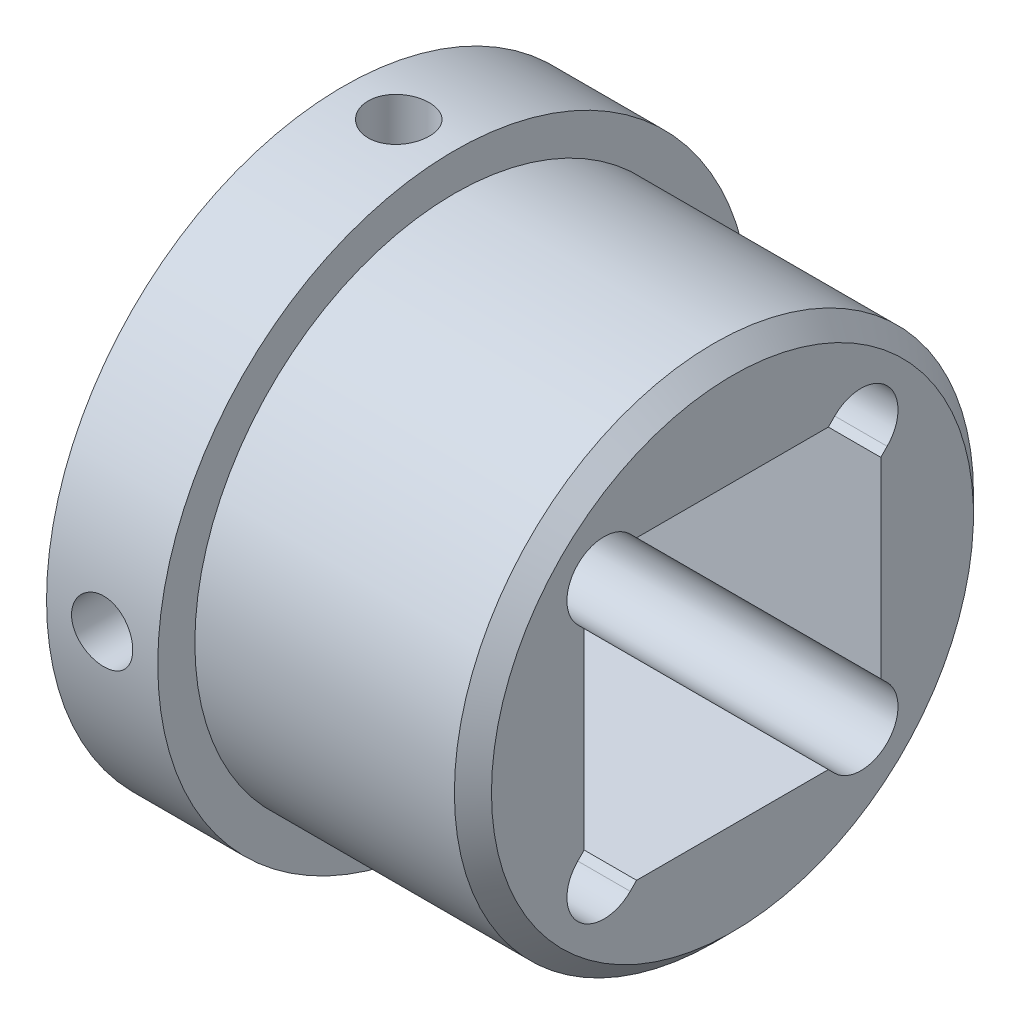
ISO-10303-21;
HEADER;
FILE_DESCRIPTION(('STEP AP214'),'2;1');
FILE_NAME('part.step','',(''),(''),'','','');
FILE_SCHEMA(('AUTOMOTIVE_DESIGN { 1 0 10303 214 1 1 1 1 }'));
ENDSEC;
DATA;
#1=APPLICATION_CONTEXT('core data for automotive mechanical design processes');
#2=APPLICATION_PROTOCOL_DEFINITION('international standard','automotive_design',2000,#1);
#3=PRODUCT_CONTEXT('',#1,'mechanical');
#4=PRODUCT('Part','Part','',(#3));
#5=PRODUCT_RELATED_PRODUCT_CATEGORY('part','',(#4));
#6=PRODUCT_DEFINITION_FORMATION('','',#4);
#7=PRODUCT_DEFINITION_CONTEXT('part definition',#1,'design');
#8=PRODUCT_DEFINITION('design','',#6,#7);
#9=PRODUCT_DEFINITION_SHAPE('','',#8);
#10=(LENGTH_UNIT() NAMED_UNIT(*) SI_UNIT(.MILLI.,.METRE.));
#11=(NAMED_UNIT(*) PLANE_ANGLE_UNIT() SI_UNIT($,.RADIAN.));
#12=(NAMED_UNIT(*) SI_UNIT($,.STERADIAN.) SOLID_ANGLE_UNIT());
#13=UNCERTAINTY_MEASURE_WITH_UNIT(LENGTH_MEASURE(1.E-05),#10,'distance_accuracy_value','');
#14=(GEOMETRIC_REPRESENTATION_CONTEXT(3) GLOBAL_UNCERTAINTY_ASSIGNED_CONTEXT((#13)) GLOBAL_UNIT_ASSIGNED_CONTEXT((#10,
#11,#12)) REPRESENTATION_CONTEXT('',''));
#15=CARTESIAN_POINT('',(0.,0.,0.));
#16=DIRECTION('',(0.,0.,1.));
#17=DIRECTION('',(1.,0.,0.));
#18=AXIS2_PLACEMENT_3D('',#15,#16,#17);
#19=CARTESIAN_POINT('',(0.,-8.,8.));
#20=DIRECTION('',(0.,-1.,0.));
#21=DIRECTION('',(0.,0.,-1.));
#22=AXIS2_PLACEMENT_3D('',#19,#20,#21);
#23=PLANE('',#22);
#24=DIRECTION('',(0.,0.,-1.));
#25=VECTOR('',#24,1.);
#26=CARTESIAN_POINT('',(0.,-8.,8.));
#27=LINE('',#26,#25);
#28=CARTESIAN_POINT('',(0.,-8.,5.17157287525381));
#29=VERTEX_POINT('',#28);
#30=CARTESIAN_POINT('',(0.,-8.00000000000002,-5.17157287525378));
#31=VERTEX_POINT('',#30);
#32=EDGE_CURVE('E286',#29,#31,#27,.T.);
#33=ORIENTED_EDGE('',*,*,#32,.F.);
#34=DIRECTION('',(1.,0.,0.));
#35=VECTOR('',#34,1.);
#36=CARTESIAN_POINT('',(0.,-8.,5.17157287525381));
#37=LINE('',#36,#35);
#38=CARTESIAN_POINT('',(21.,-8.,5.17157287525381));
#39=VERTEX_POINT('',#38);
#40=EDGE_CURVE('E213',#29,#39,#37,.T.);
#41=ORIENTED_EDGE('',*,*,#40,.T.);
#42=DIRECTION('',(0.,0.,-1.));
#43=VECTOR('',#42,1.);
#44=CARTESIAN_POINT('',(21.,-8.,8.));
#45=LINE('',#44,#43);
#46=CARTESIAN_POINT('',(21.,-8.00000000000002,-5.17157287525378));
#47=VERTEX_POINT('',#46);
#48=EDGE_CURVE('E296',#39,#47,#45,.T.);
#49=ORIENTED_EDGE('',*,*,#48,.T.);
#50=DIRECTION('',(1.,0.,0.));
#51=VECTOR('',#50,1.);
#52=CARTESIAN_POINT('',(0.,-8.00000000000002,-5.17157287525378));
#53=LINE('',#52,#51);
#54=EDGE_CURVE('E237',#31,#47,#53,.T.);
#55=ORIENTED_EDGE('',*,*,#54,.F.);
#56=EDGE_LOOP('',(#33,#41,#49,#55));
#57=FACE_BOUND('',#56,.T.);
#58=CARTESIAN_POINT('',(3.,-8.,0.));
#59=DIRECTION('',(0.,1.,0.));
#60=DIRECTION('',(0.,0.,1.));
#61=AXIS2_PLACEMENT_3D('',#58,#59,#60);
#62=CIRCLE('',#61,1.64999999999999);
#63=CARTESIAN_POINT('',(3.,-8.,1.64999999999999));
#64=VERTEX_POINT('',#63);
#65=EDGE_CURVE('E273',#64,#64,#62,.T.);
#66=ORIENTED_EDGE('',*,*,#65,.F.);
#67=EDGE_LOOP('',(#66));
#68=FACE_BOUND('',#67,.T.);
#69=ADVANCED_FACE('F37',(#57,#68),#23,.F.);
#70=CARTESIAN_POINT('',(0.,0.,0.));
#71=DIRECTION('',(1.,0.,0.));
#72=DIRECTION('',(0.,0.,-1.));
#73=AXIS2_PLACEMENT_3D('',#70,#71,#72);
#74=PLANE('',#73);
#75=DIRECTION('',(0.,0.,1.));
#76=VECTOR('',#75,1.);
#77=CARTESIAN_POINT('',(0.,8.,8.));
#78=LINE('',#77,#76);
#79=CARTESIAN_POINT('',(0.,8.,-5.17157287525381));
#80=VERTEX_POINT('',#79);
#81=CARTESIAN_POINT('',(0.,8.,5.17157287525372));
#82=VERTEX_POINT('',#81);
#83=EDGE_CURVE('E291',#80,#82,#78,.T.);
#84=ORIENTED_EDGE('',*,*,#83,.T.);
#85=DIRECTION('',(0.,0.707106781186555,0.70710678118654));
#86=VECTOR('',#85,1.);
#87=CARTESIAN_POINT('',(0.,8.34386001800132,5.51543289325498));
#88=LINE('',#87,#86);
#89=CARTESIAN_POINT('',(0.,8.34386001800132,5.51543289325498));
#90=VERTEX_POINT('',#89);
#91=EDGE_CURVE('E58',#82,#90,#88,.T.);
#92=ORIENTED_EDGE('',*,*,#91,.T.);
#93=CARTESIAN_POINT('',(0.,6.92964645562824,6.92964645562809));
#94=DIRECTION('',(1.,0.,0.));
#95=DIRECTION('',(0.,1.,0.));
#96=AXIS2_PLACEMENT_3D('',#93,#94,#95);
#97=CIRCLE('',#96,2.);
#98=CARTESIAN_POINT('',(0.,5.51543289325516,8.34386001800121));
#99=VERTEX_POINT('',#98);
#100=EDGE_CURVE('E162',#90,#99,#97,.T.);
#101=ORIENTED_EDGE('',*,*,#100,.T.);
#102=DIRECTION('',(0.,-0.707106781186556,-0.707106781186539));
#103=VECTOR('',#102,1.);
#104=CARTESIAN_POINT('',(0.,5.51543289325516,8.34386001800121));
#105=LINE('',#104,#103);
#106=CARTESIAN_POINT('',(0.,5.1715728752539,7.99999999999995));
#107=VERTEX_POINT('',#106);
#108=EDGE_CURVE('E169',#99,#107,#105,.T.);
#109=ORIENTED_EDGE('',*,*,#108,.T.);
#110=DIRECTION('',(0.,-1.,0.));
#111=VECTOR('',#110,1.);
#112=CARTESIAN_POINT('',(0.,8.,8.));
#113=LINE('',#112,#111);
#114=CARTESIAN_POINT('',(0.,-5.1715728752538,8.));
#115=VERTEX_POINT('',#114);
#116=EDGE_CURVE('E66',#107,#115,#113,.T.);
#117=ORIENTED_EDGE('',*,*,#116,.T.);
#118=DIRECTION('',(0.,-0.707106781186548,0.707106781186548));
#119=VECTOR('',#118,1.);
#120=CARTESIAN_POINT('',(0.,-5.51543289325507,8.34386001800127));
#121=LINE('',#120,#119);
#122=CARTESIAN_POINT('',(0.,-5.51543289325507,8.34386001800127));
#123=VERTEX_POINT('',#122);
#124=EDGE_CURVE('E198',#115,#123,#121,.T.);
#125=ORIENTED_EDGE('',*,*,#124,.T.);
#126=CARTESIAN_POINT('',(0.,-6.92964645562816,6.92964645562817));
#127=DIRECTION('',(1.,0.,0.));
#128=DIRECTION('',(0.,0.,1.));
#129=AXIS2_PLACEMENT_3D('',#126,#127,#128);
#130=CIRCLE('',#129,2.);
#131=CARTESIAN_POINT('',(0.,-8.34386001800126,5.51543289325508));
#132=VERTEX_POINT('',#131);
#133=EDGE_CURVE('E191',#123,#132,#130,.T.);
#134=ORIENTED_EDGE('',*,*,#133,.T.);
#135=DIRECTION('',(0.,0.707106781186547,-0.707106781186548));
#136=VECTOR('',#135,1.);
#137=CARTESIAN_POINT('',(0.,-8.34386001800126,5.51543289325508));
#138=LINE('',#137,#136);
#139=EDGE_CURVE('E194',#132,#29,#138,.T.);
#140=ORIENTED_EDGE('',*,*,#139,.T.);
#141=ORIENTED_EDGE('',*,*,#32,.T.);
#142=DIRECTION('',(0.,-0.70710678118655,-0.707106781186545));
#143=VECTOR('',#142,1.);
#144=CARTESIAN_POINT('',(0.,-8.34386001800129,-5.51543289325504));
#145=LINE('',#144,#143);
#146=CARTESIAN_POINT('',(0.,-8.34386001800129,-5.51543289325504));
#147=VERTEX_POINT('',#146);
#148=EDGE_CURVE('E224',#31,#147,#145,.T.);
#149=ORIENTED_EDGE('',*,*,#148,.T.);
#150=CARTESIAN_POINT('',(0.,-6.92964645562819,-6.92964645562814));
#151=DIRECTION('',(1.,0.,0.));
#152=DIRECTION('',(0.,-1.,0.));
#153=AXIS2_PLACEMENT_3D('',#150,#151,#152);
#154=CIRCLE('',#153,2.);
#155=CARTESIAN_POINT('',(0.,-5.51543289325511,-8.34386001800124));
#156=VERTEX_POINT('',#155);
#157=EDGE_CURVE('E217',#147,#156,#154,.T.);
#158=ORIENTED_EDGE('',*,*,#157,.T.);
#159=DIRECTION('',(0.,0.707106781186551,0.707106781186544));
#160=VECTOR('',#159,1.);
#161=CARTESIAN_POINT('',(0.,-5.51543289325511,-8.34386001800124));
#162=LINE('',#161,#160);
#163=CARTESIAN_POINT('',(0.,-5.17157287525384,-7.99999999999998));
#164=VERTEX_POINT('',#163);
#165=EDGE_CURVE('E220',#156,#164,#162,.T.);
#166=ORIENTED_EDGE('',*,*,#165,.T.);
#167=DIRECTION('',(0.,1.,0.));
#168=VECTOR('',#167,1.);
#169=CARTESIAN_POINT('',(0.,8.,-8.));
#170=LINE('',#169,#168);
#171=CARTESIAN_POINT('',(0.,5.1715728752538,-8.));
#172=VERTEX_POINT('',#171);
#173=EDGE_CURVE('E289',#164,#172,#170,.T.);
#174=ORIENTED_EDGE('',*,*,#173,.T.);
#175=DIRECTION('',(0.,0.707106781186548,-0.707106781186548));
#176=VECTOR('',#175,1.);
#177=CARTESIAN_POINT('',(0.,5.51543289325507,-8.34386001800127));
#178=LINE('',#177,#176);
#179=CARTESIAN_POINT('',(0.,5.51543289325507,-8.34386001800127));
#180=VERTEX_POINT('',#179);
#181=EDGE_CURVE('E251',#172,#180,#178,.T.);
#182=ORIENTED_EDGE('',*,*,#181,.T.);
#183=CARTESIAN_POINT('',(0.,6.92964645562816,-6.92964645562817));
#184=DIRECTION('',(1.,0.,0.));
#185=DIRECTION('',(0.,0.,-1.));
#186=AXIS2_PLACEMENT_3D('',#183,#184,#185);
#187=CIRCLE('',#186,2.);
#188=CARTESIAN_POINT('',(0.,8.34386001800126,-5.51543289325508));
#189=VERTEX_POINT('',#188);
#190=EDGE_CURVE('E244',#180,#189,#187,.T.);
#191=ORIENTED_EDGE('',*,*,#190,.T.);
#192=DIRECTION('',(0.,-0.707106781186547,0.707106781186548));
#193=VECTOR('',#192,1.);
#194=CARTESIAN_POINT('',(0.,8.34386001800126,-5.51543289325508));
#195=LINE('',#194,#193);
#196=EDGE_CURVE('E247',#189,#80,#195,.T.);
#197=ORIENTED_EDGE('',*,*,#196,.T.);
#198=EDGE_LOOP('',(#84,#92,#101,#109,#117,#125,#134,#140,#141,#149,#158,#166,#174,#182,#191,#197));
#199=FACE_BOUND('',#198,.T.);
#200=CARTESIAN_POINT('',(0.,0.,0.));
#201=DIRECTION('',(-1.,0.,0.));
#202=DIRECTION('',(0.,0.,1.));
#203=AXIS2_PLACEMENT_3D('',#200,#201,#202);
#204=CIRCLE('',#203,16.);
#205=CARTESIAN_POINT('',(0.,0.,16.));
#206=VERTEX_POINT('',#205);
#207=EDGE_CURVE('E307',#206,#206,#204,.T.);
#208=ORIENTED_EDGE('',*,*,#207,.T.);
#209=EDGE_LOOP('',(#208));
#210=FACE_BOUND('',#209,.T.);
#211=ADVANCED_FACE('F174',(#199,#210),#74,.F.);
#212=CARTESIAN_POINT('',(-19.0972157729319,0.,0.));
#213=DIRECTION('',(-1.,0.,0.));
#214=DIRECTION('',(0.,0.,1.));
#215=AXIS2_PLACEMENT_3D('',#212,#213,#214);
#216=CYLINDRICAL_SURFACE('',#215,16.);
#217=CARTESIAN_POINT('',(4.64999999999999,0.,16.));
#218=CARTESIAN_POINT('',(4.64999600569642,-0.0924179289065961,15.9999989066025));
#219=CARTESIAN_POINT('',(4.64220924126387,-0.184896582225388,15.9991907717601));
#220=CARTESIAN_POINT('',(4.6112644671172,-0.367288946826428,15.9960446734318));
#221=CARTESIAN_POINT('',(4.58808962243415,-0.457199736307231,15.9937050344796));
#222=CARTESIAN_POINT('',(4.52705145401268,-0.631788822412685,15.9877599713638));
#223=CARTESIAN_POINT('',(4.48919711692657,-0.716470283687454,15.9841553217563));
#224=CARTESIAN_POINT('',(4.39989221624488,-0.878259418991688,15.9760830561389));
#225=CARTESIAN_POINT('',(4.34844431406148,-0.955368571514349,15.9716156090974));
#226=CARTESIAN_POINT('',(4.23320217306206,-1.10013660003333,15.9622989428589));
#227=CARTESIAN_POINT('',(4.1693666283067,-1.16776251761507,15.9574484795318));
#228=CARTESIAN_POINT('',(4.03124945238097,-1.29136107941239,15.94792271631));
#229=CARTESIAN_POINT('',(3.95696733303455,-1.34733317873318,15.9432474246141));
#230=CARTESIAN_POINT('',(3.79985832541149,-1.44615275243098,15.9345887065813));
#231=CARTESIAN_POINT('',(3.71701250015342,-1.48897027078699,15.930606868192));
#232=CARTESIAN_POINT('',(3.54525894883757,-1.56007397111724,15.9238014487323));
#233=CARTESIAN_POINT('',(3.45635138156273,-1.5883605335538,15.9209778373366));
#234=CARTESIAN_POINT('',(3.27533502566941,-1.62950135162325,15.9168199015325));
#235=CARTESIAN_POINT('',(3.18323881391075,-1.64241040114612,15.915480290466));
#236=CARTESIAN_POINT('',(2.99817797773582,-1.65259915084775,15.9144256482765));
#237=CARTESIAN_POINT('',(2.90521337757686,-1.64987928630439,15.914710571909));
#238=CARTESIAN_POINT('',(2.72143286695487,-1.62893255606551,15.9168679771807));
#239=CARTESIAN_POINT('',(2.63061004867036,-1.61076557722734,15.9187343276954));
#240=CARTESIAN_POINT('',(2.45330938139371,-1.55953352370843,15.9238347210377));
#241=CARTESIAN_POINT('',(2.36683159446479,-1.5264682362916,15.9270687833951));
#242=CARTESIAN_POINT('',(2.20048695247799,-1.44631226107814,15.9345472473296));
#243=CARTESIAN_POINT('',(2.1206329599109,-1.39919506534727,15.9387935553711));
#244=CARTESIAN_POINT('',(1.9699434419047,-1.29229179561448,15.9478164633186));
#245=CARTESIAN_POINT('',(1.89910819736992,-1.23250532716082,15.9525930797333));
#246=CARTESIAN_POINT('',(1.76811897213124,-1.10162643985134,15.962165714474));
#247=CARTESIAN_POINT('',(1.70801664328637,-1.03048231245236,15.9669617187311));
#248=CARTESIAN_POINT('',(1.60059988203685,-0.879087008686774,15.9760116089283));
#249=CARTESIAN_POINT('',(1.55328546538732,-0.798835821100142,15.9802654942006));
#250=CARTESIAN_POINT('',(1.4727894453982,-0.631468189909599,15.987753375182));
#251=CARTESIAN_POINT('',(1.43961053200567,-0.544350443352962,15.9909871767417));
#252=CARTESIAN_POINT('',(1.38836555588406,-0.365739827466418,15.9960685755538));
#253=CARTESIAN_POINT('',(1.37029901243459,-0.274247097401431,15.9979162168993));
#254=CARTESIAN_POINT('',(1.34985730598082,-0.0899308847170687,16.0000114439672));
#255=CARTESIAN_POINT('',(1.34741088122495,0.00288461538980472,16.0002662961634));
#256=CARTESIAN_POINT('',(1.35809158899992,0.187604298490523,15.9991667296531));
#257=CARTESIAN_POINT('',(1.37121849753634,0.279508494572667,15.9978123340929));
#258=CARTESIAN_POINT('',(1.41261411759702,0.459590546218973,15.993651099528));
#259=CARTESIAN_POINT('',(1.44084939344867,0.547776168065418,15.9908474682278));
#260=CARTESIAN_POINT('',(1.51162584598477,0.718159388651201,15.9841022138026));
#261=CARTESIAN_POINT('',(1.554167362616,0.800356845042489,15.9801605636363));
#262=CARTESIAN_POINT('',(1.6525249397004,0.95675220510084,15.9715618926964));
#263=CARTESIAN_POINT('',(1.7083877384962,1.03092057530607,15.9669023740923));
#264=CARTESIAN_POINT('',(1.83173522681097,1.16885327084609,15.9573986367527));
#265=CARTESIAN_POINT('',(1.89922022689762,1.23261731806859,15.9525544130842));
#266=CARTESIAN_POINT('',(2.04420774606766,1.34817938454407,15.9432053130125));
#267=CARTESIAN_POINT('',(2.1217476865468,1.3999305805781,15.9387018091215));
#268=CARTESIAN_POINT('',(2.28445977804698,1.48967585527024,15.9305651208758));
#269=CARTESIAN_POINT('',(2.36963181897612,1.52767013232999,15.9269319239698));
#270=CARTESIAN_POINT('',(2.54503088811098,1.58874495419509,15.920955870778));
#271=CARTESIAN_POINT('',(2.63524818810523,1.61185319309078,15.9186106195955));
#272=CARTESIAN_POINT('',(2.81830783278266,1.64258976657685,15.9154686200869));
#273=CARTESIAN_POINT('',(2.91115009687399,1.65021857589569,15.9146718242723));
#274=CARTESIAN_POINT('',(3.09635878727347,1.64977290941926,15.9147179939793));
#275=CARTESIAN_POINT('',(3.18872540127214,1.64177198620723,15.9155532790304));
#276=CARTESIAN_POINT('',(3.37079474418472,1.6104483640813,15.9187531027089));
#277=CARTESIAN_POINT('',(3.46049747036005,1.58712564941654,15.9211176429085));
#278=CARTESIAN_POINT('',(3.6346910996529,1.52584110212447,15.9271073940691));
#279=CARTESIAN_POINT('',(3.7191828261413,1.48788158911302,15.9307324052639));
#280=CARTESIAN_POINT('',(3.88060763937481,1.3984084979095,15.9388350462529));
#281=CARTESIAN_POINT('',(3.95754075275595,1.34689496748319,15.9433126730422));
#282=CARTESIAN_POINT('',(4.10204139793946,1.23150018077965,15.9526412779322));
#283=CARTESIAN_POINT('',(4.16956504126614,1.16756409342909,15.9574938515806));
#284=CARTESIAN_POINT('',(4.29295679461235,1.02924864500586,15.9670110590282));
#285=CARTESIAN_POINT('',(4.34882211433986,0.954866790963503,15.9716756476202));
#286=CARTESIAN_POINT('',(4.44742960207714,0.797553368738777,15.9803043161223));
#287=CARTESIAN_POINT('',(4.49013649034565,0.714599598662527,15.9842665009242));
#288=CARTESIAN_POINT('',(4.56095733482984,0.54270963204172,15.9910235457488));
#289=CARTESIAN_POINT('',(4.58908767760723,0.453780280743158,15.9938197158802));
#290=CARTESIAN_POINT('',(4.6229740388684,0.303626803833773,15.9972302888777));
#291=CARTESIAN_POINT('',(4.6330948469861,0.243361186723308,15.9982640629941));
#292=CARTESIAN_POINT('',(4.64660913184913,0.122072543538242,15.9996492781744));
#293=CARTESIAN_POINT('',(4.65000263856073,0.0610495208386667,16.0000007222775));
#294=CARTESIAN_POINT('',(4.64999999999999,0.,16.));
#295=B_SPLINE_CURVE_WITH_KNOTS('',3,(#217,#218,#219,#220,#221,#222,#223,#224,#225,#226,#227,
#228,#229,#230,#231,#232,#233,#234,#235,#236,#237,#238,#239,#240,#241,#242,#243,#244,#245,#246,
#247,#248,#249,#250,#251,#252,#253,#254,#255,#256,#257,#258,#259,#260,#261,#262,#263,#264,#265,
#266,#267,#268,#269,#270,#271,#272,#273,#274,#275,#276,#277,#278,#279,#280,#281,#282,#283,#284,
#285,#286,#287,#288,#289,#290,#291,#292,#293,#294),.UNSPECIFIED.,.T.,.F.,(4,2,2,2,2,2,2,2,2,2,2,
2,2,2,2,2,2,2,2,2,2,2,2,2,2,2,2,2,2,2,2,2,2,2,2,2,2,2,4),(0.,0.277030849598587,
0.554365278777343,0.831530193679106,1.10864088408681,1.38669197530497,1.66475606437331,
1.94344875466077,2.22213414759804,2.49982351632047,2.77750515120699,3.05411512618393,
3.33072905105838,3.60786812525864,3.88501582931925,4.16346332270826,4.44191115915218,
4.72041195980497,4.99890390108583,5.27612439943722,5.5533409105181,5.82994644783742,
6.10655855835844,6.38415583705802,6.66176053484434,6.94042975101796,7.21909494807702,
7.49724020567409,7.77537693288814,8.05220791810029,8.32903918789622,8.60582660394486,
8.88261304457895,9.16065012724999,9.43875367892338,9.71759650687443,9.99612518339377,
10.1791272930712,10.3621285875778),.UNSPECIFIED.);
#296=CARTESIAN_POINT('',(4.64999999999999,0.,16.));
#297=VERTEX_POINT('',#296);
#298=EDGE_CURVE('E41',#297,#297,#295,.T.);
#299=ORIENTED_EDGE('',*,*,#298,.T.);
#300=EDGE_LOOP('',(#299));
#301=FACE_BOUND('',#300,.T.);
#302=CARTESIAN_POINT('',(3.,-15.9146944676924,1.64999999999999));
#303=CARTESIAN_POINT('',(3.09241645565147,-15.9146955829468,1.64999600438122));
#304=CARTESIAN_POINT('',(3.18489364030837,-15.9155081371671,1.64220947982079));
#305=CARTESIAN_POINT('',(3.36728295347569,-15.9186700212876,1.61126574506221));
#306=CARTESIAN_POINT('',(3.45719215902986,-15.9210210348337,1.58809169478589));
#307=CARTESIAN_POINT('',(3.63177789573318,-15.9269907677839,1.52705585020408));
#308=CARTESIAN_POINT('',(3.71645760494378,-15.9306087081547,1.48920308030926));
#309=CARTESIAN_POINT('',(3.87824380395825,-15.9387036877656,1.39990187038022));
#310=CARTESIAN_POINT('',(3.95535177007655,-15.9431805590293,1.34845608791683));
#311=CARTESIAN_POINT('',(4.10012113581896,-15.9525083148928,1.23321608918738));
#312=CARTESIAN_POINT('',(4.16774920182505,-15.9573604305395,1.16938009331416));
#313=CARTESIAN_POINT('',(4.29135191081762,-15.9668808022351,1.03126111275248));
#314=CARTESIAN_POINT('',(4.34732601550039,-15.9715490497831,0.956977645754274));
#315=CARTESIAN_POINT('',(4.44614768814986,-15.9801879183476,0.799867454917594));
#316=CARTESIAN_POINT('',(4.48896566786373,-15.9841569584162,0.717022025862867));
#317=CARTESIAN_POINT('',(4.56007033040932,-15.9909367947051,0.545269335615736));
#318=CARTESIAN_POINT('',(4.58835738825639,-15.9937476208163,0.456362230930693));
#319=CARTESIAN_POINT('',(4.6294992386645,-15.9978856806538,0.275347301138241));
#320=CARTESIAN_POINT('',(4.64240886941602,-15.9992181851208,0.183252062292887));
#321=CARTESIAN_POINT('',(4.65259911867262,-16.0002673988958,-0.00180686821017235));
#322=CARTESIAN_POINT('',(4.64988016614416,-15.9999841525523,-0.0947705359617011));
#323=CARTESIAN_POINT('',(4.62893488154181,-15.9978380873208,-0.278555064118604));
#324=CARTESIAN_POINT('',(4.61076751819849,-15.995981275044,-0.369382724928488));
#325=CARTESIAN_POINT('',(4.55953301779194,-15.9909036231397,-0.546692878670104));
#326=CARTESIAN_POINT('',(4.52646567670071,-15.9876827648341,-0.63317531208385));
#327=CARTESIAN_POINT('',(4.44630544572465,-15.980228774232,-0.79952559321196));
#328=CARTESIAN_POINT('',(4.3991865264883,-15.9759937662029,-0.879380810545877));
#329=CARTESIAN_POINT('',(4.29227957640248,-15.9669865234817,-1.03007204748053));
#330=CARTESIAN_POINT('',(4.2324911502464,-15.962214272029,-1.10090778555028));
#331=CARTESIAN_POINT('',(4.10161087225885,-15.9526417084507,-1.23189480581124));
#332=CARTESIAN_POINT('',(4.03046771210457,-15.9478413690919,-1.29199483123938));
#333=CARTESIAN_POINT('',(3.87907516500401,-15.938775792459,-1.39940740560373));
#334=CARTESIAN_POINT('',(3.79882576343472,-15.9345105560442,-1.44671993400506));
#335=CARTESIAN_POINT('',(3.63145862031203,-15.9269977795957,-1.52721459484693));
#336=CARTESIAN_POINT('',(3.54433929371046,-15.9237504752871,-1.56039345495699));
#337=CARTESIAN_POINT('',(3.36572524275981,-15.9186460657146,-1.6116378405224));
#338=CARTESIAN_POINT('',(3.27423066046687,-15.9167889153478,-1.62970385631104));
#339=CARTESIAN_POINT('',(3.0899135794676,-15.9146829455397,-1.65014357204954));
#340=CARTESIAN_POINT('',(2.99709911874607,-15.9144267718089,-1.65258902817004));
#341=CARTESIAN_POINT('',(2.81238174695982,-15.9155323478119,-1.64190675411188));
#342=CARTESIAN_POINT('',(2.72047882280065,-15.9168940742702,-1.62877924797));
#343=CARTESIAN_POINT('',(2.54040313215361,-15.9210753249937,-1.58738376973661));
#344=CARTESIAN_POINT('',(2.45222246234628,-15.9238915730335,-1.55914981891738));
#345=CARTESIAN_POINT('',(2.28184855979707,-15.9306618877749,-1.48837767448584));
#346=CARTESIAN_POINT('',(2.19965547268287,-15.9346159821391,-1.44583913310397));
#347=CARTESIAN_POINT('',(2.04326310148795,-15.9432342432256,-1.34748594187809));
#348=CARTESIAN_POINT('',(1.96909382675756,-15.9479009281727,-1.29162379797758));
#349=CARTESIAN_POINT('',(1.83115900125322,-15.9574103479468,-1.16827709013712));
#350=CARTESIAN_POINT('',(1.76739372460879,-15.9622530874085,-1.10079222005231));
#351=CARTESIAN_POINT('',(1.65182898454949,-15.9715912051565,-0.955804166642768));
#352=CARTESIAN_POINT('',(1.60007637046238,-15.976085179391,-0.878263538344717));
#353=CARTESIAN_POINT('',(1.51032860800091,-15.9841989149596,-0.715549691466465));
#354=CARTESIAN_POINT('',(1.47233326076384,-15.98781868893,-0.630376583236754));
#355=CARTESIAN_POINT('',(1.41125773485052,-15.993769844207,-0.454978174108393));
#356=CARTESIAN_POINT('',(1.38814939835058,-15.9961036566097,-0.364762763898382));
#357=CARTESIAN_POINT('',(1.35741198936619,-15.9992299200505,-0.181707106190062));
#358=CARTESIAN_POINT('',(1.34978245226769,-16.0000224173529,-0.0888669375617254));
#359=CARTESIAN_POINT('',(1.35022598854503,-15.9999767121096,0.09634298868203));
#360=CARTESIAN_POINT('',(1.35822638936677,-15.9991460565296,0.188712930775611));
#361=CARTESIAN_POINT('',(1.38955013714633,-15.9959622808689,0.370789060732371));
#362=CARTESIAN_POINT('',(1.41287349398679,-15.9936091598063,0.460495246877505));
#363=CARTESIAN_POINT('',(1.47416063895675,-15.9876440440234,0.63469583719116));
#364=CARTESIAN_POINT('',(1.51212214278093,-15.9840322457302,0.719191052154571));
#365=CARTESIAN_POINT('',(1.60160029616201,-15.9759520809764,0.880622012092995));
#366=CARTESIAN_POINT('',(1.65311689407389,-15.9714837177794,0.957557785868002));
#367=CARTESIAN_POINT('',(1.76851506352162,-15.962165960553,1.10205829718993));
#368=CARTESIAN_POINT('',(1.83245076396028,-15.9573149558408,1.16957970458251));
#369=CARTESIAN_POINT('',(1.97076451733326,-15.9477922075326,1.29296712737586));
#370=CARTESIAN_POINT('',(2.04514506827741,-15.9431205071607,1.34883034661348));
#371=CARTESIAN_POINT('',(2.20245741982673,-15.9344718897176,1.44743556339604));
#372=CARTESIAN_POINT('',(2.28541165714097,-15.930496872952,1.49014190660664));
#373=CARTESIAN_POINT('',(2.45730261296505,-15.9237142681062,1.56096160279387));
#374=CARTESIAN_POINT('',(2.54623248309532,-15.9209053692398,1.58909134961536));
#375=CARTESIAN_POINT('',(2.69638436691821,-15.9174784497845,1.62297603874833));
#376=CARTESIAN_POINT('',(2.75664775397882,-15.9164394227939,1.63309609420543));
#377=CARTESIAN_POINT('',(2.87793192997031,-15.9150470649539,1.64660937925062));
#378=CARTESIAN_POINT('',(2.93895271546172,-15.9146937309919,1.65000263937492));
#379=CARTESIAN_POINT('',(3.,-15.9146944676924,1.64999999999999));
#380=B_SPLINE_CURVE_WITH_KNOTS('',3,(#302,#303,#304,#305,#306,#307,#308,#309,#310,#311,#312,
#313,#314,#315,#316,#317,#318,#319,#320,#321,#322,#323,#324,#325,#326,#327,#328,#329,#330,#331,
#332,#333,#334,#335,#336,#337,#338,#339,#340,#341,#342,#343,#344,#345,#346,#347,#348,#349,#350,
#351,#352,#353,#354,#355,#356,#357,#358,#359,#360,#361,#362,#363,#364,#365,#366,#367,#368,#369,
#370,#371,#372,#373,#374,#375,#376,#377,#378,#379),.UNSPECIFIED.,.T.,.F.,(4,2,2,2,2,2,2,2,2,2,2,
2,2,2,2,2,2,2,2,2,2,2,2,2,2,2,2,2,2,2,2,2,2,2,2,2,2,2,4),(0.,0.277026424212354,
0.554356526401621,0.83151639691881,1.10862211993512,1.3866790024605,1.66474872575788,
1.9434393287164,2.2221227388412,2.49980931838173,2.77748827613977,3.05411202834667,
3.33073956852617,3.60788275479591,3.88503458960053,4.16347621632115,4.44191829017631,
4.72042479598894,4.99892226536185,5.27613947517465,5.55335269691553,5.82994421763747,
6.10654246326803,6.38414182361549,6.66174849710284,6.94042029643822,7.21908806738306,
7.49722719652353,7.77535797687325,8.05219864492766,8.32903949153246,8.60583715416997,
8.88263376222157,9.16066501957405,9.43876288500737,9.71760788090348,9.9961385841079,
10.1791339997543,10.3621285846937),.UNSPECIFIED.);
#381=CARTESIAN_POINT('',(3.,-15.9146944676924,1.64999999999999));
#382=VERTEX_POINT('',#381);
#383=EDGE_CURVE('E276',#382,#382,#380,.T.);
#384=ORIENTED_EDGE('',*,*,#383,.T.);
#385=EDGE_LOOP('',(#384));
#386=FACE_BOUND('',#385,.T.);
#387=CARTESIAN_POINT('',(3.,-1.65000000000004,-15.9146944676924));
#388=CARTESIAN_POINT('',(3.09241645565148,-1.64999600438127,-15.9146955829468));
#389=CARTESIAN_POINT('',(3.18489364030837,-1.64220947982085,-15.9155081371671));
#390=CARTESIAN_POINT('',(3.3672829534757,-1.61126574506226,-15.9186700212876));
#391=CARTESIAN_POINT('',(3.45719215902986,-1.58809169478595,-15.9210210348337));
#392=CARTESIAN_POINT('',(3.63177789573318,-1.52705585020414,-15.9269907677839));
#393=CARTESIAN_POINT('',(3.71645760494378,-1.48920308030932,-15.9306087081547));
#394=CARTESIAN_POINT('',(3.87824380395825,-1.39990187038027,-15.9387036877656));
#395=CARTESIAN_POINT('',(3.95535177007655,-1.34845608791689,-15.9431805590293));
#396=CARTESIAN_POINT('',(4.10012113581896,-1.23321608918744,-15.9525083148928));
#397=CARTESIAN_POINT('',(4.16774920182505,-1.16938009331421,-15.9573604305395));
#398=CARTESIAN_POINT('',(4.29135191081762,-1.03126111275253,-15.9668808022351));
#399=CARTESIAN_POINT('',(4.34732601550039,-0.956977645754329,-15.9715490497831));
#400=CARTESIAN_POINT('',(4.44614768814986,-0.799867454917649,-15.9801879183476));
#401=CARTESIAN_POINT('',(4.48896566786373,-0.717022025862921,-15.9841569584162));
#402=CARTESIAN_POINT('',(4.56007033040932,-0.545269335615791,-15.9909367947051));
#403=CARTESIAN_POINT('',(4.58835738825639,-0.456362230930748,-15.9937476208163));
#404=CARTESIAN_POINT('',(4.6294992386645,-0.275347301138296,-15.9978856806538));
#405=CARTESIAN_POINT('',(4.64240886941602,-0.183252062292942,-15.9992181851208));
#406=CARTESIAN_POINT('',(4.65259911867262,0.00180686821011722,-16.0002673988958));
#407=CARTESIAN_POINT('',(4.64988016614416,0.094770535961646,-15.9999841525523));
#408=CARTESIAN_POINT('',(4.62893488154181,0.278555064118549,-15.9978380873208));
#409=CARTESIAN_POINT('',(4.61076751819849,0.369382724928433,-15.995981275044));
#410=CARTESIAN_POINT('',(4.55953301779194,0.546692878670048,-15.9909036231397));
#411=CARTESIAN_POINT('',(4.52646567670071,0.633175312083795,-15.9876827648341));
#412=CARTESIAN_POINT('',(4.44630544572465,0.799525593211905,-15.980228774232));
#413=CARTESIAN_POINT('',(4.3991865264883,0.879380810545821,-15.9759937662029));
#414=CARTESIAN_POINT('',(4.29227957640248,1.03007204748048,-15.9669865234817));
#415=CARTESIAN_POINT('',(4.2324911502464,1.10090778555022,-15.962214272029));
#416=CARTESIAN_POINT('',(4.10161087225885,1.23189480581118,-15.9526417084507));
#417=CARTESIAN_POINT('',(4.03046771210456,1.29199483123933,-15.9478413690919));
#418=CARTESIAN_POINT('',(3.87907516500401,1.39940740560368,-15.938775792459));
#419=CARTESIAN_POINT('',(3.79882576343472,1.446719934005,-15.9345105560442));
#420=CARTESIAN_POINT('',(3.63145862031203,1.52721459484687,-15.9269977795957));
#421=CARTESIAN_POINT('',(3.54433929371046,1.56039345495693,-15.9237504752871));
#422=CARTESIAN_POINT('',(3.36572524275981,1.61163784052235,-15.9186460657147));
#423=CARTESIAN_POINT('',(3.27423066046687,1.62970385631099,-15.9167889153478));
#424=CARTESIAN_POINT('',(3.08991357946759,1.65014357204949,-15.9146829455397));
#425=CARTESIAN_POINT('',(2.99709911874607,1.65258902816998,-15.9144267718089));
#426=CARTESIAN_POINT('',(2.81238174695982,1.64190675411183,-15.9155323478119));
#427=CARTESIAN_POINT('',(2.72047882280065,1.62877924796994,-15.9168940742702));
#428=CARTESIAN_POINT('',(2.5404031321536,1.58738376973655,-15.9210753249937));
#429=CARTESIAN_POINT('',(2.45222246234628,1.55914981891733,-15.9238915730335));
#430=CARTESIAN_POINT('',(2.28184855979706,1.48837767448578,-15.9306618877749));
#431=CARTESIAN_POINT('',(2.19965547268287,1.44583913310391,-15.9346159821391));
#432=CARTESIAN_POINT('',(2.04326310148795,1.34748594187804,-15.9432342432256));
#433=CARTESIAN_POINT('',(1.96909382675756,1.29162379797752,-15.9479009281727));
#434=CARTESIAN_POINT('',(1.83115900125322,1.16827709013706,-15.9574103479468));
#435=CARTESIAN_POINT('',(1.76739372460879,1.10079222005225,-15.9622530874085));
#436=CARTESIAN_POINT('',(1.65182898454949,0.955804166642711,-15.9715912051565));
#437=CARTESIAN_POINT('',(1.60007637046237,0.87826353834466,-15.976085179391));
#438=CARTESIAN_POINT('',(1.51032860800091,0.715549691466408,-15.9841989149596));
#439=CARTESIAN_POINT('',(1.47233326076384,0.630376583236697,-15.98781868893));
#440=CARTESIAN_POINT('',(1.41125773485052,0.454978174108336,-15.993769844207));
#441=CARTESIAN_POINT('',(1.38814939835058,0.364762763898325,-15.9961036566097));
#442=CARTESIAN_POINT('',(1.35741198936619,0.181707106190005,-15.9992299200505));
#443=CARTESIAN_POINT('',(1.34978245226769,0.0888669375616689,-16.0000224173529));
#444=CARTESIAN_POINT('',(1.35022598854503,-0.0963429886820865,-15.9999767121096));
#445=CARTESIAN_POINT('',(1.35822638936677,-0.188712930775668,-15.9991460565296));
#446=CARTESIAN_POINT('',(1.38955013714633,-0.370789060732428,-15.9959622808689));
#447=CARTESIAN_POINT('',(1.41287349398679,-0.460495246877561,-15.9936091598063));
#448=CARTESIAN_POINT('',(1.47416063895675,-0.634695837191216,-15.9876440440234));
#449=CARTESIAN_POINT('',(1.51212214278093,-0.719191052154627,-15.9840322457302));
#450=CARTESIAN_POINT('',(1.60160029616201,-0.880622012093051,-15.9759520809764));
#451=CARTESIAN_POINT('',(1.65311689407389,-0.957557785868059,-15.9714837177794));
#452=CARTESIAN_POINT('',(1.76851506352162,-1.10205829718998,-15.962165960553));
#453=CARTESIAN_POINT('',(1.83245076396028,-1.16957970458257,-15.9573149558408));
#454=CARTESIAN_POINT('',(1.97076451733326,-1.29296712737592,-15.9477922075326));
#455=CARTESIAN_POINT('',(2.04514506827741,-1.34883034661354,-15.9431205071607));
#456=CARTESIAN_POINT('',(2.20245741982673,-1.4474355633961,-15.9344718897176));
#457=CARTESIAN_POINT('',(2.28541165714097,-1.4901419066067,-15.930496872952));
#458=CARTESIAN_POINT('',(2.45730261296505,-1.56096160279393,-15.9237142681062));
#459=CARTESIAN_POINT('',(2.54623248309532,-1.58909134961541,-15.9209053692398));
#460=CARTESIAN_POINT('',(2.69638436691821,-1.62297603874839,-15.9174784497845));
#461=CARTESIAN_POINT('',(2.75664775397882,-1.63309609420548,-15.9164394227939));
#462=CARTESIAN_POINT('',(2.87793192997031,-1.64660937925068,-15.9150470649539));
#463=CARTESIAN_POINT('',(2.93895271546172,-1.65000263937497,-15.9146937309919));
#464=CARTESIAN_POINT('',(3.,-1.65000000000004,-15.9146944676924));
#465=B_SPLINE_CURVE_WITH_KNOTS('',3,(#387,#388,#389,#390,#391,#392,#393,#394,#395,#396,#397,
#398,#399,#400,#401,#402,#403,#404,#405,#406,#407,#408,#409,#410,#411,#412,#413,#414,#415,#416,
#417,#418,#419,#420,#421,#422,#423,#424,#425,#426,#427,#428,#429,#430,#431,#432,#433,#434,#435,
#436,#437,#438,#439,#440,#441,#442,#443,#444,#445,#446,#447,#448,#449,#450,#451,#452,#453,#454,
#455,#456,#457,#458,#459,#460,#461,#462,#463,#464),.UNSPECIFIED.,.T.,.F.,(4,2,2,2,2,2,2,2,2,2,2,
2,2,2,2,2,2,2,2,2,2,2,2,2,2,2,2,2,2,2,2,2,2,2,2,2,2,2,4),(0.,0.277026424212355,
0.554356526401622,0.831516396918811,1.10862211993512,1.38667900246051,1.66474872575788,
1.9434393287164,2.2221227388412,2.49980931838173,2.77748827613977,3.05411202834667,
3.33073956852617,3.60788275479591,3.88503458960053,4.16347621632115,4.44191829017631,
4.72042479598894,4.99892226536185,5.27613947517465,5.55335269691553,5.82994421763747,
6.10654246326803,6.38414182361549,6.66174849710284,6.94042029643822,7.21908806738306,
7.49722719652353,7.77535797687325,8.05219864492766,8.32903949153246,8.60583715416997,
8.88263376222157,9.16066501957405,9.43876288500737,9.71760788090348,9.9961385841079,
10.1791339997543,10.3621285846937),.UNSPECIFIED.);
#466=CARTESIAN_POINT('',(3.,-1.65000000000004,-15.9146944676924));
#467=VERTEX_POINT('',#466);
#468=EDGE_CURVE('E280',#467,#467,#465,.T.);
#469=ORIENTED_EDGE('',*,*,#468,.T.);
#470=EDGE_LOOP('',(#469));
#471=FACE_BOUND('',#470,.T.);
#472=CARTESIAN_POINT('',(3.,15.9146944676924,-1.64999999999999));
#473=CARTESIAN_POINT('',(3.09241645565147,15.9146955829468,-1.64999600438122));
#474=CARTESIAN_POINT('',(3.18489364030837,15.9155081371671,-1.64220947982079));
#475=CARTESIAN_POINT('',(3.36728295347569,15.9186700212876,-1.61126574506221));
#476=CARTESIAN_POINT('',(3.45719215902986,15.9210210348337,-1.58809169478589));
#477=CARTESIAN_POINT('',(3.63177789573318,15.9269907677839,-1.52705585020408));
#478=CARTESIAN_POINT('',(3.71645760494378,15.9306087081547,-1.48920308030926));
#479=CARTESIAN_POINT('',(3.87824380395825,15.9387036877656,-1.39990187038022));
#480=CARTESIAN_POINT('',(3.95535177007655,15.9431805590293,-1.34845608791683));
#481=CARTESIAN_POINT('',(4.10012113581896,15.9525083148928,-1.23321608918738));
#482=CARTESIAN_POINT('',(4.16774920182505,15.9573604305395,-1.16938009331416));
#483=CARTESIAN_POINT('',(4.29135191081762,15.9668808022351,-1.03126111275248));
#484=CARTESIAN_POINT('',(4.34732601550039,15.9715490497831,-0.956977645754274));
#485=CARTESIAN_POINT('',(4.44614768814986,15.9801879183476,-0.799867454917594));
#486=CARTESIAN_POINT('',(4.48896566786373,15.9841569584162,-0.717022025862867));
#487=CARTESIAN_POINT('',(4.56007033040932,15.9909367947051,-0.545269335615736));
#488=CARTESIAN_POINT('',(4.58835738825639,15.9937476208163,-0.456362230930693));
#489=CARTESIAN_POINT('',(4.6294992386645,15.9978856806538,-0.275347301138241));
#490=CARTESIAN_POINT('',(4.64240886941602,15.9992181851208,-0.183252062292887));
#491=CARTESIAN_POINT('',(4.65259911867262,16.0002673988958,0.00180686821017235));
#492=CARTESIAN_POINT('',(4.64988016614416,15.9999841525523,0.0947705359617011));
#493=CARTESIAN_POINT('',(4.62893488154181,15.9978380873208,0.278555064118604));
#494=CARTESIAN_POINT('',(4.61076751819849,15.995981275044,0.369382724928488));
#495=CARTESIAN_POINT('',(4.55953301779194,15.9909036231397,0.546692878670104));
#496=CARTESIAN_POINT('',(4.52646567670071,15.9876827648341,0.63317531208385));
#497=CARTESIAN_POINT('',(4.44630544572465,15.980228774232,0.79952559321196));
#498=CARTESIAN_POINT('',(4.3991865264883,15.9759937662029,0.879380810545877));
#499=CARTESIAN_POINT('',(4.29227957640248,15.9669865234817,1.03007204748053));
#500=CARTESIAN_POINT('',(4.2324911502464,15.962214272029,1.10090778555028));
#501=CARTESIAN_POINT('',(4.10161087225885,15.9526417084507,1.23189480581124));
#502=CARTESIAN_POINT('',(4.03046771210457,15.9478413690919,1.29199483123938));
#503=CARTESIAN_POINT('',(3.87907516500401,15.938775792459,1.39940740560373));
#504=CARTESIAN_POINT('',(3.79882576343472,15.9345105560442,1.44671993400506));
#505=CARTESIAN_POINT('',(3.63145862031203,15.9269977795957,1.52721459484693));
#506=CARTESIAN_POINT('',(3.54433929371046,15.9237504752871,1.56039345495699));
#507=CARTESIAN_POINT('',(3.36572524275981,15.9186460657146,1.6116378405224));
#508=CARTESIAN_POINT('',(3.27423066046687,15.9167889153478,1.62970385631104));
#509=CARTESIAN_POINT('',(3.0899135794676,15.9146829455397,1.65014357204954));
#510=CARTESIAN_POINT('',(2.99709911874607,15.9144267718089,1.65258902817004));
#511=CARTESIAN_POINT('',(2.81238174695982,15.9155323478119,1.64190675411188));
#512=CARTESIAN_POINT('',(2.72047882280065,15.9168940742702,1.62877924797));
#513=CARTESIAN_POINT('',(2.54040313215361,15.9210753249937,1.58738376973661));
#514=CARTESIAN_POINT('',(2.45222246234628,15.9238915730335,1.55914981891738));
#515=CARTESIAN_POINT('',(2.28184855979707,15.9306618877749,1.48837767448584));
#516=CARTESIAN_POINT('',(2.19965547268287,15.9346159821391,1.44583913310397));
#517=CARTESIAN_POINT('',(2.04326310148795,15.9432342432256,1.34748594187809));
#518=CARTESIAN_POINT('',(1.96909382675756,15.9479009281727,1.29162379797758));
#519=CARTESIAN_POINT('',(1.83115900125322,15.9574103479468,1.16827709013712));
#520=CARTESIAN_POINT('',(1.76739372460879,15.9622530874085,1.10079222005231));
#521=CARTESIAN_POINT('',(1.65182898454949,15.9715912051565,0.955804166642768));
#522=CARTESIAN_POINT('',(1.60007637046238,15.976085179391,0.878263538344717));
#523=CARTESIAN_POINT('',(1.51032860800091,15.9841989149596,0.715549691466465));
#524=CARTESIAN_POINT('',(1.47233326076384,15.98781868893,0.630376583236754));
#525=CARTESIAN_POINT('',(1.41125773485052,15.993769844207,0.454978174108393));
#526=CARTESIAN_POINT('',(1.38814939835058,15.9961036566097,0.364762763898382));
#527=CARTESIAN_POINT('',(1.35741198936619,15.9992299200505,0.181707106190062));
#528=CARTESIAN_POINT('',(1.34978245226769,16.0000224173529,0.0888669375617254));
#529=CARTESIAN_POINT('',(1.35022598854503,15.9999767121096,-0.09634298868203));
#530=CARTESIAN_POINT('',(1.35822638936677,15.9991460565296,-0.188712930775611));
#531=CARTESIAN_POINT('',(1.38955013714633,15.9959622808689,-0.370789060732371));
#532=CARTESIAN_POINT('',(1.41287349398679,15.9936091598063,-0.460495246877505));
#533=CARTESIAN_POINT('',(1.47416063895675,15.9876440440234,-0.63469583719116));
#534=CARTESIAN_POINT('',(1.51212214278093,15.9840322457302,-0.719191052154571));
#535=CARTESIAN_POINT('',(1.60160029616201,15.9759520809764,-0.880622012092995));
#536=CARTESIAN_POINT('',(1.65311689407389,15.9714837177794,-0.957557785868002));
#537=CARTESIAN_POINT('',(1.76851506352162,15.962165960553,-1.10205829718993));
#538=CARTESIAN_POINT('',(1.83245076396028,15.9573149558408,-1.16957970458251));
#539=CARTESIAN_POINT('',(1.97076451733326,15.9477922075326,-1.29296712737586));
#540=CARTESIAN_POINT('',(2.04514506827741,15.9431205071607,-1.34883034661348));
#541=CARTESIAN_POINT('',(2.20245741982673,15.9344718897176,-1.44743556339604));
#542=CARTESIAN_POINT('',(2.28541165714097,15.930496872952,-1.49014190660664));
#543=CARTESIAN_POINT('',(2.45730261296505,15.9237142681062,-1.56096160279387));
#544=CARTESIAN_POINT('',(2.54623248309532,15.9209053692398,-1.58909134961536));
#545=CARTESIAN_POINT('',(2.69638436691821,15.9174784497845,-1.62297603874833));
#546=CARTESIAN_POINT('',(2.75664775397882,15.9164394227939,-1.63309609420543));
#547=CARTESIAN_POINT('',(2.87793192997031,15.9150470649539,-1.64660937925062));
#548=CARTESIAN_POINT('',(2.93895271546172,15.9146937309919,-1.65000263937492));
#549=CARTESIAN_POINT('',(3.,15.9146944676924,-1.64999999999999));
#550=B_SPLINE_CURVE_WITH_KNOTS('',3,(#472,#473,#474,#475,#476,#477,#478,#479,#480,#481,#482,
#483,#484,#485,#486,#487,#488,#489,#490,#491,#492,#493,#494,#495,#496,#497,#498,#499,#500,#501,
#502,#503,#504,#505,#506,#507,#508,#509,#510,#511,#512,#513,#514,#515,#516,#517,#518,#519,#520,
#521,#522,#523,#524,#525,#526,#527,#528,#529,#530,#531,#532,#533,#534,#535,#536,#537,#538,#539,
#540,#541,#542,#543,#544,#545,#546,#547,#548,#549),.UNSPECIFIED.,.T.,.F.,(4,2,2,2,2,2,2,2,2,2,2,
2,2,2,2,2,2,2,2,2,2,2,2,2,2,2,2,2,2,2,2,2,2,2,2,2,2,2,4),(0.,0.277026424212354,
0.554356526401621,0.83151639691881,1.10862211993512,1.3866790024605,1.66474872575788,
1.9434393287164,2.2221227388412,2.49980931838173,2.77748827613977,3.05411202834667,
3.33073956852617,3.60788275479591,3.88503458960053,4.16347621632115,4.44191829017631,
4.72042479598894,4.99892226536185,5.27613947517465,5.55335269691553,5.82994421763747,
6.10654246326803,6.38414182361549,6.66174849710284,6.94042029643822,7.21908806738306,
7.49722719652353,7.77535797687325,8.05219864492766,8.32903949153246,8.60583715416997,
8.88263376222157,9.16066501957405,9.43876288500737,9.71760788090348,9.9961385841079,
10.1791339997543,10.3621285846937),.UNSPECIFIED.);
#551=CARTESIAN_POINT('',(3.,15.9146944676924,-1.64999999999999));
#552=VERTEX_POINT('',#551);
#553=EDGE_CURVE('E284',#552,#552,#550,.T.);
#554=ORIENTED_EDGE('',*,*,#553,.T.);
#555=EDGE_LOOP('',(#554));
#556=FACE_BOUND('',#555,.T.);
#557=ORIENTED_EDGE('',*,*,#207,.F.);
#558=EDGE_LOOP('',(#557));
#559=FACE_BOUND('',#558,.T.);
#560=CARTESIAN_POINT('',(6.,0.,0.));
#561=DIRECTION('',(-1.,0.,0.));
#562=DIRECTION('',(0.,0.,1.));
#563=AXIS2_PLACEMENT_3D('',#560,#561,#562);
#564=CIRCLE('',#563,16.);
#565=CARTESIAN_POINT('',(6.,0.,16.));
#566=VERTEX_POINT('',#565);
#567=EDGE_CURVE('E304',#566,#566,#564,.T.);
#568=ORIENTED_EDGE('',*,*,#567,.T.);
#569=EDGE_LOOP('',(#568));
#570=FACE_BOUND('',#569,.T.);
#571=ADVANCED_FACE('F320',(#301,#386,#471,#556,#559,#570),#216,.T.);
#572=CARTESIAN_POINT('',(6.,-16.,1.1172740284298E-13));
#573=DIRECTION('',(-1.,0.,0.));
#574=DIRECTION('',(0.,0.,1.));
#575=AXIS2_PLACEMENT_3D('',#572,#573,#574);
#576=PLANE('',#575);
#577=ORIENTED_EDGE('',*,*,#567,.F.);
#578=EDGE_LOOP('',(#577));
#579=FACE_BOUND('',#578,.T.);
#580=CARTESIAN_POINT('',(6.,0.,0.));
#581=DIRECTION('',(-1.,0.,0.));
#582=DIRECTION('',(0.,0.,1.));
#583=AXIS2_PLACEMENT_3D('',#580,#581,#582);
#584=CIRCLE('',#583,14.);
#585=CARTESIAN_POINT('',(6.,0.,14.));
#586=VERTEX_POINT('',#585);
#587=EDGE_CURVE('E293',#586,#586,#584,.T.);
#588=ORIENTED_EDGE('',*,*,#587,.T.);
#589=EDGE_LOOP('',(#588));
#590=FACE_BOUND('',#589,.T.);
#591=ADVANCED_FACE('F352',(#579,#590),#576,.F.);
#592=CARTESIAN_POINT('',(-19.0972157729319,0.,0.));
#593=DIRECTION('',(-1.,0.,0.));
#594=DIRECTION('',(0.,0.,1.));
#595=AXIS2_PLACEMENT_3D('',#592,#593,#594);
#596=CYLINDRICAL_SURFACE('',#595,14.);
#597=CARTESIAN_POINT('',(20.,0.,0.));
#598=DIRECTION('',(-1.,0.,0.));
#599=DIRECTION('',(0.,0.,1.));
#600=AXIS2_PLACEMENT_3D('',#597,#598,#599);
#601=CIRCLE('',#600,14.);
#602=CARTESIAN_POINT('',(20.,0.,14.));
#603=VERTEX_POINT('',#602);
#604=EDGE_CURVE('E50',#603,#603,#601,.T.);
#605=ORIENTED_EDGE('',*,*,#604,.T.);
#606=EDGE_LOOP('',(#605));
#607=FACE_BOUND('',#606,.T.);
#608=ORIENTED_EDGE('',*,*,#587,.F.);
#609=EDGE_LOOP('',(#608));
#610=FACE_BOUND('',#609,.T.);
#611=ADVANCED_FACE('F349',(#607,#610),#596,.T.);
#612=CARTESIAN_POINT('',(21.,0.,0.));
#613=DIRECTION('',(-1.,0.,0.));
#614=DIRECTION('',(0.,0.,1.));
#615=AXIS2_PLACEMENT_3D('',#612,#613,#614);
#616=PLANE('',#615);
#617=CARTESIAN_POINT('',(21.,0.,0.));
#618=DIRECTION('',(-1.,0.,0.));
#619=DIRECTION('',(0.,0.,1.));
#620=AXIS2_PLACEMENT_3D('',#617,#618,#619);
#621=CIRCLE('',#620,13.);
#622=CARTESIAN_POINT('',(21.,0.,13.));
#623=VERTEX_POINT('',#622);
#624=EDGE_CURVE('E11',#623,#623,#621,.F.);
#625=ORIENTED_EDGE('',*,*,#624,.T.);
#626=EDGE_LOOP('',(#625));
#627=FACE_BOUND('',#626,.T.);
#628=CARTESIAN_POINT('',(21.,6.92964645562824,6.92964645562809));
#629=DIRECTION('',(1.,0.,0.));
#630=DIRECTION('',(0.,1.,0.));
#631=AXIS2_PLACEMENT_3D('',#628,#629,#630);
#632=CIRCLE('',#631,2.);
#633=CARTESIAN_POINT('',(21.,8.34386001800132,5.51543289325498));
#634=VERTEX_POINT('',#633);
#635=CARTESIAN_POINT('',(21.,5.51543289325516,8.34386001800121));
#636=VERTEX_POINT('',#635);
#637=EDGE_CURVE('E164',#634,#636,#632,.T.);
#638=ORIENTED_EDGE('',*,*,#637,.F.);
#639=DIRECTION('',(0.,0.707106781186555,0.70710678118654));
#640=VECTOR('',#639,1.);
#641=CARTESIAN_POINT('',(21.,8.34386001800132,5.51543289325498));
#642=LINE('',#641,#640);
#643=CARTESIAN_POINT('',(21.,8.00000000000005,5.17157287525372));
#644=VERTEX_POINT('',#643);
#645=EDGE_CURVE('E176',#644,#634,#642,.T.);
#646=ORIENTED_EDGE('',*,*,#645,.F.);
#647=DIRECTION('',(0.,0.,1.));
#648=VECTOR('',#647,1.);
#649=CARTESIAN_POINT('',(21.,8.,8.));
#650=LINE('',#649,#648);
#651=CARTESIAN_POINT('',(21.,8.,-5.17157287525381));
#652=VERTEX_POINT('',#651);
#653=EDGE_CURVE('E287',#652,#644,#650,.T.);
#654=ORIENTED_EDGE('',*,*,#653,.F.);
#655=DIRECTION('',(0.,-0.707106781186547,0.707106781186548));
#656=VECTOR('',#655,1.);
#657=CARTESIAN_POINT('',(21.,8.34386001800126,-5.51543289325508));
#658=LINE('',#657,#656);
#659=CARTESIAN_POINT('',(21.,8.34386001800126,-5.51543289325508));
#660=VERTEX_POINT('',#659);
#661=EDGE_CURVE('E257',#660,#652,#658,.T.);
#662=ORIENTED_EDGE('',*,*,#661,.F.);
#663=CARTESIAN_POINT('',(21.,6.92964645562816,-6.92964645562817));
#664=DIRECTION('',(1.,0.,0.));
#665=DIRECTION('',(0.,0.,-1.));
#666=AXIS2_PLACEMENT_3D('',#663,#664,#665);
#667=CIRCLE('',#666,2.);
#668=CARTESIAN_POINT('',(21.,5.51543289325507,-8.34386001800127));
#669=VERTEX_POINT('',#668);
#670=EDGE_CURVE('E236',#669,#660,#667,.T.);
#671=ORIENTED_EDGE('',*,*,#670,.F.);
#672=DIRECTION('',(0.,0.707106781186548,-0.707106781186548));
#673=VECTOR('',#672,1.);
#674=CARTESIAN_POINT('',(21.,5.51543289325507,-8.34386001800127));
#675=LINE('',#674,#673);
#676=CARTESIAN_POINT('',(21.,5.1715728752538,-8.));
#677=VERTEX_POINT('',#676);
#678=EDGE_CURVE('E248',#677,#669,#675,.T.);
#679=ORIENTED_EDGE('',*,*,#678,.F.);
#680=DIRECTION('',(0.,1.,0.));
#681=VECTOR('',#680,1.);
#682=CARTESIAN_POINT('',(21.,8.,-8.));
#683=LINE('',#682,#681);
#684=CARTESIAN_POINT('',(21.,-5.17157287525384,-8.));
#685=VERTEX_POINT('',#684);
#686=EDGE_CURVE('E298',#685,#677,#683,.T.);
#687=ORIENTED_EDGE('',*,*,#686,.F.);
#688=DIRECTION('',(0.,0.707106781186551,0.707106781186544));
#689=VECTOR('',#688,1.);
#690=CARTESIAN_POINT('',(21.,-5.51543289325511,-8.34386001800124));
#691=LINE('',#690,#689);
#692=CARTESIAN_POINT('',(21.,-5.51543289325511,-8.34386001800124));
#693=VERTEX_POINT('',#692);
#694=EDGE_CURVE('E230',#693,#685,#691,.T.);
#695=ORIENTED_EDGE('',*,*,#694,.F.);
#696=CARTESIAN_POINT('',(21.,-6.92964645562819,-6.92964645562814));
#697=DIRECTION('',(1.,0.,0.));
#698=DIRECTION('',(0.,-1.,0.));
#699=AXIS2_PLACEMENT_3D('',#696,#697,#698);
#700=CIRCLE('',#699,2.);
#701=CARTESIAN_POINT('',(21.,-8.34386001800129,-5.51543289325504));
#702=VERTEX_POINT('',#701);
#703=EDGE_CURVE('E209',#702,#693,#700,.T.);
#704=ORIENTED_EDGE('',*,*,#703,.F.);
#705=DIRECTION('',(0.,-0.70710678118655,-0.707106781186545));
#706=VECTOR('',#705,1.);
#707=CARTESIAN_POINT('',(21.,-8.34386001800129,-5.51543289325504));
#708=LINE('',#707,#706);
#709=EDGE_CURVE('E221',#47,#702,#708,.T.);
#710=ORIENTED_EDGE('',*,*,#709,.F.);
#711=ORIENTED_EDGE('',*,*,#48,.F.);
#712=DIRECTION('',(0.,0.707106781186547,-0.707106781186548));
#713=VECTOR('',#712,1.);
#714=CARTESIAN_POINT('',(21.,-8.34386001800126,5.51543289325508));
#715=LINE('',#714,#713);
#716=CARTESIAN_POINT('',(21.,-8.34386001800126,5.51543289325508));
#717=VERTEX_POINT('',#716);
#718=EDGE_CURVE('E203',#717,#39,#715,.T.);
#719=ORIENTED_EDGE('',*,*,#718,.F.);
#720=CARTESIAN_POINT('',(21.,-6.92964645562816,6.92964645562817));
#721=DIRECTION('',(1.,0.,0.));
#722=DIRECTION('',(0.,0.,1.));
#723=AXIS2_PLACEMENT_3D('',#720,#721,#722);
#724=CIRCLE('',#723,2.);
#725=CARTESIAN_POINT('',(21.,-5.51543289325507,8.34386001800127));
#726=VERTEX_POINT('',#725);
#727=EDGE_CURVE('E187',#726,#717,#724,.T.);
#728=ORIENTED_EDGE('',*,*,#727,.F.);
#729=DIRECTION('',(0.,-0.707106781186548,0.707106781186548));
#730=VECTOR('',#729,1.);
#731=CARTESIAN_POINT('',(21.,-5.51543289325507,8.34386001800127));
#732=LINE('',#731,#730);
#733=CARTESIAN_POINT('',(21.,-5.1715728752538,8.));
#734=VERTEX_POINT('',#733);
#735=EDGE_CURVE('E195',#734,#726,#732,.T.);
#736=ORIENTED_EDGE('',*,*,#735,.F.);
#737=DIRECTION('',(0.,-1.,0.));
#738=VECTOR('',#737,1.);
#739=CARTESIAN_POINT('',(21.,8.,8.));
#740=LINE('',#739,#738);
#741=CARTESIAN_POINT('',(21.,5.1715728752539,7.99999999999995));
#742=VERTEX_POINT('',#741);
#743=EDGE_CURVE('E294',#742,#734,#740,.T.);
#744=ORIENTED_EDGE('',*,*,#743,.F.);
#745=DIRECTION('',(0.,-0.707106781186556,-0.707106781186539));
#746=VECTOR('',#745,1.);
#747=CARTESIAN_POINT('',(21.,5.51543289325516,8.34386001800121));
#748=LINE('',#747,#746);
#749=EDGE_CURVE('E179',#636,#742,#748,.T.);
#750=ORIENTED_EDGE('',*,*,#749,.F.);
#751=EDGE_LOOP('',(#638,#646,#654,#662,#671,#679,#687,#695,#704,#710,#711,#719,#728,#736,#744,#750));
#752=FACE_BOUND('',#751,.T.);
#753=ADVANCED_FACE('F345',(#627,#752),#616,.F.);
#754=CARTESIAN_POINT('',(0.,8.,8.));
#755=DIRECTION('',(0.,0.,1.));
#756=DIRECTION('',(0.,-1.,0.));
#757=AXIS2_PLACEMENT_3D('',#754,#755,#756);
#758=PLANE('',#757);
#759=CARTESIAN_POINT('',(3.,0.,8.));
#760=DIRECTION('',(0.,0.,-1.));
#761=DIRECTION('',(0.,1.,0.));
#762=AXIS2_PLACEMENT_3D('',#759,#760,#761);
#763=CIRCLE('',#762,1.64999999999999);
#764=CARTESIAN_POINT('',(3.,1.65000000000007,7.99999999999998));
#765=VERTEX_POINT('',#764);
#766=EDGE_CURVE('E263',#765,#765,#763,.T.);
#767=ORIENTED_EDGE('',*,*,#766,.F.);
#768=EDGE_LOOP('',(#767));
#769=FACE_BOUND('',#768,.T.);
#770=ORIENTED_EDGE('',*,*,#116,.F.);
#771=DIRECTION('',(1.,0.,0.));
#772=VECTOR('',#771,1.);
#773=CARTESIAN_POINT('',(0.,5.1715728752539,7.99999999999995));
#774=LINE('',#773,#772);
#775=EDGE_CURVE('E167',#107,#742,#774,.T.);
#776=ORIENTED_EDGE('',*,*,#775,.T.);
#777=ORIENTED_EDGE('',*,*,#743,.T.);
#778=DIRECTION('',(1.,0.,0.));
#779=VECTOR('',#778,1.);
#780=CARTESIAN_POINT('',(0.,-5.1715728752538,8.));
#781=LINE('',#780,#779);
#782=EDGE_CURVE('E210',#115,#734,#781,.T.);
#783=ORIENTED_EDGE('',*,*,#782,.F.);
#784=EDGE_LOOP('',(#770,#776,#777,#783));
#785=FACE_BOUND('',#784,.T.);
#786=ADVANCED_FACE('F335',(#769,#785),#758,.F.);
#787=CARTESIAN_POINT('',(0.,8.,8.));
#788=DIRECTION('',(0.,1.,0.));
#789=DIRECTION('',(0.,0.,1.));
#790=AXIS2_PLACEMENT_3D('',#787,#788,#789);
#791=PLANE('',#790);
#792=CARTESIAN_POINT('',(3.,8.,0.));
#793=DIRECTION('',(0.,-1.,0.));
#794=DIRECTION('',(0.,0.,-1.));
#795=AXIS2_PLACEMENT_3D('',#792,#793,#794);
#796=CIRCLE('',#795,1.64999999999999);
#797=CARTESIAN_POINT('',(3.,8.,-1.64999999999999));
#798=VERTEX_POINT('',#797);
#799=EDGE_CURVE('E281',#798,#798,#796,.T.);
#800=ORIENTED_EDGE('',*,*,#799,.F.);
#801=EDGE_LOOP('',(#800));
#802=FACE_BOUND('',#801,.T.);
#803=ORIENTED_EDGE('',*,*,#653,.T.);
#804=DIRECTION('',(1.,0.,0.));
#805=VECTOR('',#804,1.);
#806=CARTESIAN_POINT('',(0.,8.00000000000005,5.17157287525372));
#807=LINE('',#806,#805);
#808=EDGE_CURVE('E188',#82,#644,#807,.T.);
#809=ORIENTED_EDGE('',*,*,#808,.F.);
#810=ORIENTED_EDGE('',*,*,#83,.F.);
#811=DIRECTION('',(1.,0.,0.));
#812=VECTOR('',#811,1.);
#813=CARTESIAN_POINT('',(0.,8.,-5.17157287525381));
#814=LINE('',#813,#812);
#815=EDGE_CURVE('E267',#80,#652,#814,.T.);
#816=ORIENTED_EDGE('',*,*,#815,.T.);
#817=EDGE_LOOP('',(#803,#809,#810,#816));
#818=FACE_BOUND('',#817,.T.);
#819=ADVANCED_FACE('F331',(#802,#818),#791,.F.);
#820=CARTESIAN_POINT('',(0.,8.,-8.));
#821=DIRECTION('',(0.,0.,-1.));
#822=DIRECTION('',(-1.,0.,0.));
#823=AXIS2_PLACEMENT_3D('',#820,#821,#822);
#824=PLANE('',#823);
#825=CARTESIAN_POINT('',(3.,0.,-8.));
#826=DIRECTION('',(0.,0.,1.));
#827=DIRECTION('',(0.,-1.,0.));
#828=AXIS2_PLACEMENT_3D('',#825,#826,#827);
#829=CIRCLE('',#828,1.64999999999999);
#830=CARTESIAN_POINT('',(3.,-1.65000000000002,-7.99999999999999));
#831=VERTEX_POINT('',#830);
#832=EDGE_CURVE('E277',#831,#831,#829,.T.);
#833=ORIENTED_EDGE('',*,*,#832,.F.);
#834=EDGE_LOOP('',(#833));
#835=FACE_BOUND('',#834,.T.);
#836=ORIENTED_EDGE('',*,*,#173,.F.);
#837=DIRECTION('',(1.,0.,0.));
#838=VECTOR('',#837,1.);
#839=CARTESIAN_POINT('',(0.,-5.17157287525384,-7.99999999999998));
#840=LINE('',#839,#838);
#841=EDGE_CURVE('E240',#164,#685,#840,.T.);
#842=ORIENTED_EDGE('',*,*,#841,.T.);
#843=ORIENTED_EDGE('',*,*,#686,.T.);
#844=DIRECTION('',(1.,0.,0.));
#845=VECTOR('',#844,1.);
#846=CARTESIAN_POINT('',(0.,5.1715728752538,-8.));
#847=LINE('',#846,#845);
#848=EDGE_CURVE('E264',#172,#677,#847,.T.);
#849=ORIENTED_EDGE('',*,*,#848,.F.);
#850=EDGE_LOOP('',(#836,#842,#843,#849));
#851=FACE_BOUND('',#850,.T.);
#852=ADVANCED_FACE('F334',(#835,#851),#824,.F.);
#853=CARTESIAN_POINT('',(20.,0.,0.));
#854=DIRECTION('',(-1.,0.,0.));
#855=DIRECTION('',(0.,0.,1.));
#856=AXIS2_PLACEMENT_3D('',#853,#854,#855);
#857=CONICAL_SURFACE('',#856,14.,0.785398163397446);
#858=ORIENTED_EDGE('',*,*,#624,.F.);
#859=EDGE_LOOP('',(#858));
#860=FACE_BOUND('',#859,.T.);
#861=ORIENTED_EDGE('',*,*,#604,.F.);
#862=EDGE_LOOP('',(#861));
#863=FACE_BOUND('',#862,.T.);
#864=ADVANCED_FACE('F39',(#860,#863),#857,.T.);
#865=CARTESIAN_POINT('',(3.,8.,0.));
#866=DIRECTION('',(0.,-1.,0.));
#867=DIRECTION('',(0.,0.,-1.));
#868=AXIS2_PLACEMENT_3D('',#865,#866,#867);
#869=CYLINDRICAL_SURFACE('',#868,1.64999999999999);
#870=ORIENTED_EDGE('',*,*,#799,.T.);
#871=EDGE_LOOP('',(#870));
#872=FACE_BOUND('',#871,.T.);
#873=ORIENTED_EDGE('',*,*,#553,.F.);
#874=EDGE_LOOP('',(#873));
#875=FACE_BOUND('',#874,.T.);
#876=ADVANCED_FACE('F323',(#872,#875),#869,.F.);
#877=CARTESIAN_POINT('',(3.,0.,-8.));
#878=DIRECTION('',(0.,0.,1.));
#879=DIRECTION('',(0.,-1.,0.));
#880=AXIS2_PLACEMENT_3D('',#877,#878,#879);
#881=CYLINDRICAL_SURFACE('',#880,1.64999999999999);
#882=ORIENTED_EDGE('',*,*,#832,.T.);
#883=EDGE_LOOP('',(#882));
#884=FACE_BOUND('',#883,.T.);
#885=ORIENTED_EDGE('',*,*,#468,.F.);
#886=EDGE_LOOP('',(#885));
#887=FACE_BOUND('',#886,.T.);
#888=ADVANCED_FACE('F327',(#884,#887),#881,.F.);
#889=CARTESIAN_POINT('',(3.,-8.,0.));
#890=DIRECTION('',(0.,1.,0.));
#891=DIRECTION('',(0.,0.,1.));
#892=AXIS2_PLACEMENT_3D('',#889,#890,#891);
#893=CYLINDRICAL_SURFACE('',#892,1.64999999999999);
#894=ORIENTED_EDGE('',*,*,#65,.T.);
#895=EDGE_LOOP('',(#894));
#896=FACE_BOUND('',#895,.T.);
#897=ORIENTED_EDGE('',*,*,#383,.F.);
#898=EDGE_LOOP('',(#897));
#899=FACE_BOUND('',#898,.T.);
#900=ADVANCED_FACE('F386',(#896,#899),#893,.F.);
#901=CARTESIAN_POINT('',(3.,0.,8.));
#902=DIRECTION('',(0.,0.,-1.));
#903=DIRECTION('',(0.,1.,0.));
#904=AXIS2_PLACEMENT_3D('',#901,#902,#903);
#905=CYLINDRICAL_SURFACE('',#904,1.64999999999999);
#906=ORIENTED_EDGE('',*,*,#766,.T.);
#907=EDGE_LOOP('',(#906));
#908=FACE_BOUND('',#907,.T.);
#909=ORIENTED_EDGE('',*,*,#298,.F.);
#910=EDGE_LOOP('',(#909));
#911=FACE_BOUND('',#910,.T.);
#912=ADVANCED_FACE('F391',(#908,#911),#905,.F.);
#913=CARTESIAN_POINT('',(0.,6.92964645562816,-6.92964645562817));
#914=DIRECTION('',(1.,0.,0.));
#915=DIRECTION('',(0.,0.,-1.));
#916=AXIS2_PLACEMENT_3D('',#913,#914,#915);
#917=CYLINDRICAL_SURFACE('',#916,2.);
#918=ORIENTED_EDGE('',*,*,#670,.T.);
#919=DIRECTION('',(1.,0.,0.));
#920=VECTOR('',#919,1.);
#921=CARTESIAN_POINT('',(0.,8.34386001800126,-5.51543289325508));
#922=LINE('',#921,#920);
#923=EDGE_CURVE('E254',#189,#660,#922,.T.);
#924=ORIENTED_EDGE('',*,*,#923,.F.);
#925=ORIENTED_EDGE('',*,*,#190,.F.);
#926=DIRECTION('',(1.,0.,0.));
#927=VECTOR('',#926,1.);
#928=CARTESIAN_POINT('',(0.,5.51543289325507,-8.34386001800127));
#929=LINE('',#928,#927);
#930=EDGE_CURVE('E261',#180,#669,#929,.T.);
#931=ORIENTED_EDGE('',*,*,#930,.T.);
#932=EDGE_LOOP('',(#918,#924,#925,#931));
#933=FACE_BOUND('',#932,.T.);
#934=ADVANCED_FACE('F406',(#933),#917,.F.);
#935=CARTESIAN_POINT('',(0.,5.51543289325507,-8.34386001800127));
#936=DIRECTION('',(0.,-0.707106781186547,-0.707106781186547));
#937=DIRECTION('',(0.,0.707106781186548,-0.707106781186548));
#938=AXIS2_PLACEMENT_3D('',#935,#936,#937);
#939=PLANE('',#938);
#940=ORIENTED_EDGE('',*,*,#678,.T.);
#941=ORIENTED_EDGE('',*,*,#930,.F.);
#942=ORIENTED_EDGE('',*,*,#181,.F.);
#943=ORIENTED_EDGE('',*,*,#848,.T.);
#944=EDGE_LOOP('',(#940,#941,#942,#943));
#945=FACE_BOUND('',#944,.T.);
#946=ADVANCED_FACE('F401',(#945),#939,.F.);
#947=CARTESIAN_POINT('',(0.,8.34386001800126,-5.51543289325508));
#948=DIRECTION('',(0.,0.707106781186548,0.707106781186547));
#949=DIRECTION('',(0.,-0.707106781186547,0.707106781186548));
#950=AXIS2_PLACEMENT_3D('',#947,#948,#949);
#951=PLANE('',#950);
#952=ORIENTED_EDGE('',*,*,#661,.T.);
#953=ORIENTED_EDGE('',*,*,#815,.F.);
#954=ORIENTED_EDGE('',*,*,#196,.F.);
#955=ORIENTED_EDGE('',*,*,#923,.T.);
#956=EDGE_LOOP('',(#952,#953,#954,#955));
#957=FACE_BOUND('',#956,.T.);
#958=ADVANCED_FACE('F455',(#957),#951,.F.);
#959=CARTESIAN_POINT('',(0.,-6.92964645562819,-6.92964645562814));
#960=DIRECTION('',(1.,0.,0.));
#961=DIRECTION('',(0.,0.,-1.));
#962=AXIS2_PLACEMENT_3D('',#959,#960,#961);
#963=CYLINDRICAL_SURFACE('',#962,2.);
#964=ORIENTED_EDGE('',*,*,#703,.T.);
#965=DIRECTION('',(1.,0.,0.));
#966=VECTOR('',#965,1.);
#967=CARTESIAN_POINT('',(0.,-5.51543289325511,-8.34386001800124));
#968=LINE('',#967,#966);
#969=EDGE_CURVE('E227',#156,#693,#968,.T.);
#970=ORIENTED_EDGE('',*,*,#969,.F.);
#971=ORIENTED_EDGE('',*,*,#157,.F.);
#972=DIRECTION('',(1.,0.,0.));
#973=VECTOR('',#972,1.);
#974=CARTESIAN_POINT('',(0.,-8.34386001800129,-5.51543289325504));
#975=LINE('',#974,#973);
#976=EDGE_CURVE('E234',#147,#702,#975,.T.);
#977=ORIENTED_EDGE('',*,*,#976,.T.);
#978=EDGE_LOOP('',(#964,#970,#971,#977));
#979=FACE_BOUND('',#978,.T.);
#980=ADVANCED_FACE('F440',(#979),#963,.F.);
#981=CARTESIAN_POINT('',(0.,-8.34386001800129,-5.51543289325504));
#982=DIRECTION('',(0.,-0.707106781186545,0.70710678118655));
#983=DIRECTION('',(0.,-0.70710678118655,-0.707106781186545));
#984=AXIS2_PLACEMENT_3D('',#981,#982,#983);
#985=PLANE('',#984);
#986=ORIENTED_EDGE('',*,*,#709,.T.);
#987=ORIENTED_EDGE('',*,*,#976,.F.);
#988=ORIENTED_EDGE('',*,*,#148,.F.);
#989=ORIENTED_EDGE('',*,*,#54,.T.);
#990=EDGE_LOOP('',(#986,#987,#988,#989));
#991=FACE_BOUND('',#990,.T.);
#992=ADVANCED_FACE('F436',(#991),#985,.F.);
#993=CARTESIAN_POINT('',(0.,-5.51543289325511,-8.34386001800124));
#994=DIRECTION('',(0.,0.707106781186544,-0.707106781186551));
#995=DIRECTION('',(0.,0.707106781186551,0.707106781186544));
#996=AXIS2_PLACEMENT_3D('',#993,#994,#995);
#997=PLANE('',#996);
#998=ORIENTED_EDGE('',*,*,#694,.T.);
#999=ORIENTED_EDGE('',*,*,#841,.F.);
#1000=ORIENTED_EDGE('',*,*,#165,.F.);
#1001=ORIENTED_EDGE('',*,*,#969,.T.);
#1002=EDGE_LOOP('',(#998,#999,#1000,#1001));
#1003=FACE_BOUND('',#1002,.T.);
#1004=ADVANCED_FACE('F443',(#1003),#997,.F.);
#1005=CARTESIAN_POINT('',(0.,-6.92964645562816,6.92964645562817));
#1006=DIRECTION('',(1.,0.,0.));
#1007=DIRECTION('',(0.,0.,-1.));
#1008=AXIS2_PLACEMENT_3D('',#1005,#1006,#1007);
#1009=CYLINDRICAL_SURFACE('',#1008,2.);
#1010=ORIENTED_EDGE('',*,*,#727,.T.);
#1011=DIRECTION('',(1.,0.,0.));
#1012=VECTOR('',#1011,1.);
#1013=CARTESIAN_POINT('',(0.,-8.34386001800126,5.51543289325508));
#1014=LINE('',#1013,#1012);
#1015=EDGE_CURVE('E200',#132,#717,#1014,.T.);
#1016=ORIENTED_EDGE('',*,*,#1015,.F.);
#1017=ORIENTED_EDGE('',*,*,#133,.F.);
#1018=DIRECTION('',(1.,0.,0.));
#1019=VECTOR('',#1018,1.);
#1020=CARTESIAN_POINT('',(0.,-5.51543289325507,8.34386001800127));
#1021=LINE('',#1020,#1019);
#1022=EDGE_CURVE('E207',#123,#726,#1021,.T.);
#1023=ORIENTED_EDGE('',*,*,#1022,.T.);
#1024=EDGE_LOOP('',(#1010,#1016,#1017,#1023));
#1025=FACE_BOUND('',#1024,.T.);
#1026=ADVANCED_FACE('F426',(#1025),#1009,.F.);
#1027=CARTESIAN_POINT('',(0.,-5.51543289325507,8.34386001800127));
#1028=DIRECTION('',(0.,0.707106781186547,0.707106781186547));
#1029=DIRECTION('',(0.,-0.707106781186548,0.707106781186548));
#1030=AXIS2_PLACEMENT_3D('',#1027,#1028,#1029);
#1031=PLANE('',#1030);
#1032=ORIENTED_EDGE('',*,*,#735,.T.);
#1033=ORIENTED_EDGE('',*,*,#1022,.F.);
#1034=ORIENTED_EDGE('',*,*,#124,.F.);
#1035=ORIENTED_EDGE('',*,*,#782,.T.);
#1036=EDGE_LOOP('',(#1032,#1033,#1034,#1035));
#1037=FACE_BOUND('',#1036,.T.);
#1038=ADVANCED_FACE('F421',(#1037),#1031,.F.);
#1039=CARTESIAN_POINT('',(0.,-8.34386001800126,5.51543289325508));
#1040=DIRECTION('',(0.,-0.707106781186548,-0.707106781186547));
#1041=DIRECTION('',(0.,0.707106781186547,-0.707106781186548));
#1042=AXIS2_PLACEMENT_3D('',#1039,#1040,#1041);
#1043=PLANE('',#1042);
#1044=ORIENTED_EDGE('',*,*,#718,.T.);
#1045=ORIENTED_EDGE('',*,*,#40,.F.);
#1046=ORIENTED_EDGE('',*,*,#139,.F.);
#1047=ORIENTED_EDGE('',*,*,#1015,.T.);
#1048=EDGE_LOOP('',(#1044,#1045,#1046,#1047));
#1049=FACE_BOUND('',#1048,.T.);
#1050=ADVANCED_FACE('F512',(#1049),#1043,.F.);
#1051=CARTESIAN_POINT('',(0.,6.92964645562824,6.92964645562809));
#1052=DIRECTION('',(1.,0.,0.));
#1053=DIRECTION('',(0.,0.,-1.));
#1054=AXIS2_PLACEMENT_3D('',#1051,#1052,#1053);
#1055=CYLINDRICAL_SURFACE('',#1054,2.);
#1056=ORIENTED_EDGE('',*,*,#637,.T.);
#1057=DIRECTION('',(1.,0.,0.));
#1058=VECTOR('',#1057,1.);
#1059=CARTESIAN_POINT('',(0.,5.51543289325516,8.34386001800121));
#1060=LINE('',#1059,#1058);
#1061=EDGE_CURVE('E158',#99,#636,#1060,.T.);
#1062=ORIENTED_EDGE('',*,*,#1061,.F.);
#1063=ORIENTED_EDGE('',*,*,#100,.F.);
#1064=DIRECTION('',(1.,0.,0.));
#1065=VECTOR('',#1064,1.);
#1066=CARTESIAN_POINT('',(0.,8.34386001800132,5.51543289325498));
#1067=LINE('',#1066,#1065);
#1068=EDGE_CURVE('E185',#90,#634,#1067,.T.);
#1069=ORIENTED_EDGE('',*,*,#1068,.T.);
#1070=EDGE_LOOP('',(#1056,#1062,#1063,#1069));
#1071=FACE_BOUND('',#1070,.T.);
#1072=ADVANCED_FACE('F160',(#1071),#1055,.F.);
#1073=CARTESIAN_POINT('',(0.,8.34386001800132,5.51543289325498));
#1074=DIRECTION('',(0.,0.70710678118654,-0.707106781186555));
#1075=DIRECTION('',(0.,0.707106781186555,0.70710678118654));
#1076=AXIS2_PLACEMENT_3D('',#1073,#1074,#1075);
#1077=PLANE('',#1076);
#1078=ORIENTED_EDGE('',*,*,#645,.T.);
#1079=ORIENTED_EDGE('',*,*,#1068,.F.);
#1080=ORIENTED_EDGE('',*,*,#91,.F.);
#1081=ORIENTED_EDGE('',*,*,#808,.T.);
#1082=EDGE_LOOP('',(#1078,#1079,#1080,#1081));
#1083=FACE_BOUND('',#1082,.T.);
#1084=ADVANCED_FACE('F413',(#1083),#1077,.F.);
#1085=CARTESIAN_POINT('',(0.,5.51543289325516,8.34386001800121));
#1086=DIRECTION('',(0.,-0.707106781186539,0.707106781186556));
#1087=DIRECTION('',(0.,-0.707106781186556,-0.707106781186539));
#1088=AXIS2_PLACEMENT_3D('',#1085,#1086,#1087);
#1089=PLANE('',#1088);
#1090=ORIENTED_EDGE('',*,*,#749,.T.);
#1091=ORIENTED_EDGE('',*,*,#775,.F.);
#1092=ORIENTED_EDGE('',*,*,#108,.F.);
#1093=ORIENTED_EDGE('',*,*,#1061,.T.);
#1094=EDGE_LOOP('',(#1090,#1091,#1092,#1093));
#1095=FACE_BOUND('',#1094,.T.);
#1096=ADVANCED_FACE('F170',(#1095),#1089,.F.);
#1097=CLOSED_SHELL('',(#69,#211,#571,#591,#611,#753,#786,#819,#852,#864,#876,#888,#900,#912,
#934,#946,#958,#980,#992,#1004,#1026,#1038,#1050,#1072,#1084,#1096));
#1098=MANIFOLD_SOLID_BREP('B2',#1097);
#1099=ADVANCED_BREP_SHAPE_REPRESENTATION('',(#18,#1098),#14);
#1100=SHAPE_DEFINITION_REPRESENTATION(#9,#1099);
ENDSEC;
END-ISO-10303-21;
